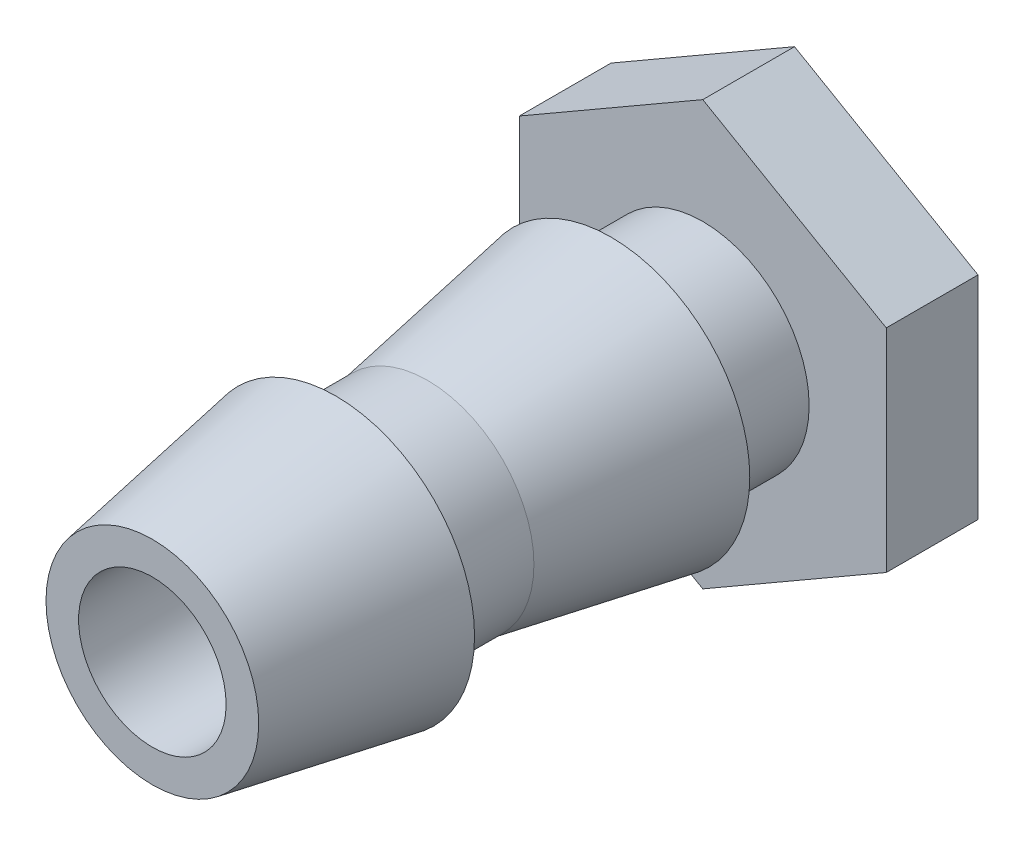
from build123d import *

# Parameters (mm, degrees)
BASE_EXTRUDE_DEPTH      = 3.175
SKETCH2_R               = 4.8006
BOSS_EXTRUDE1_DEPTH     = 19.05
F_1_4_20_TAPPED_HOLE1_D = 5.1054


with BuildPart() as part:
    # Sketch1 → Base-Extrude (new body)
    with BuildSketch(Plane.XY):
        Polygon((6.35, 3.666174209), (0, 7.332348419), (-6.35, 3.666174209), (-6.35, -3.666174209), (0, -7.332348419), (6.35, -3.666174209), align=None)
    extrude(amount=BASE_EXTRUDE_DEPTH)

    # Sketch2 → Boss-Extrude1 (add)
    with BuildSketch(Plane.XY.offset(3.175)):
        Circle(SKETCH2_R)
    extrude(amount=BOSS_EXTRUDE1_DEPTH)

    # 1_4-20 Tapped Hole1 (through all)
    with Locations(Plane.XY.offset(22.225)):
        with Locations((0, 0)):
            Hole(F_1_4_20_TAPPED_HOLE1_D / 2)

    # Sketch6 → Cut-Revolve1 (revolve, cut)
    with BuildSketch(Plane(origin=(0, 0, 0), x_dir=(0, 0, -1), z_dir=(1, 0, 0)), mode=Mode.PRIVATE) as cut_revolve1_sk:
        Polygon((-22.225, 3.680923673), (-15.875, 4.8006), (-15.875, 3.680923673), (-12.7, 3.680923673), (-6.35, 4.8006), (-6.35, 3.680923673), (-3.175, 3.680923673), (-3.175, 12.7), (-22.225, 12.7), align=None)
    revolve(cut_revolve1_sk.sketch.rotate(Axis((0, 0, 0), (0, 0, 1)), 90), axis=Axis((0, 0, 0), (0, 0, 1)), mode=Mode.SUBTRACT)


solid = part.part
